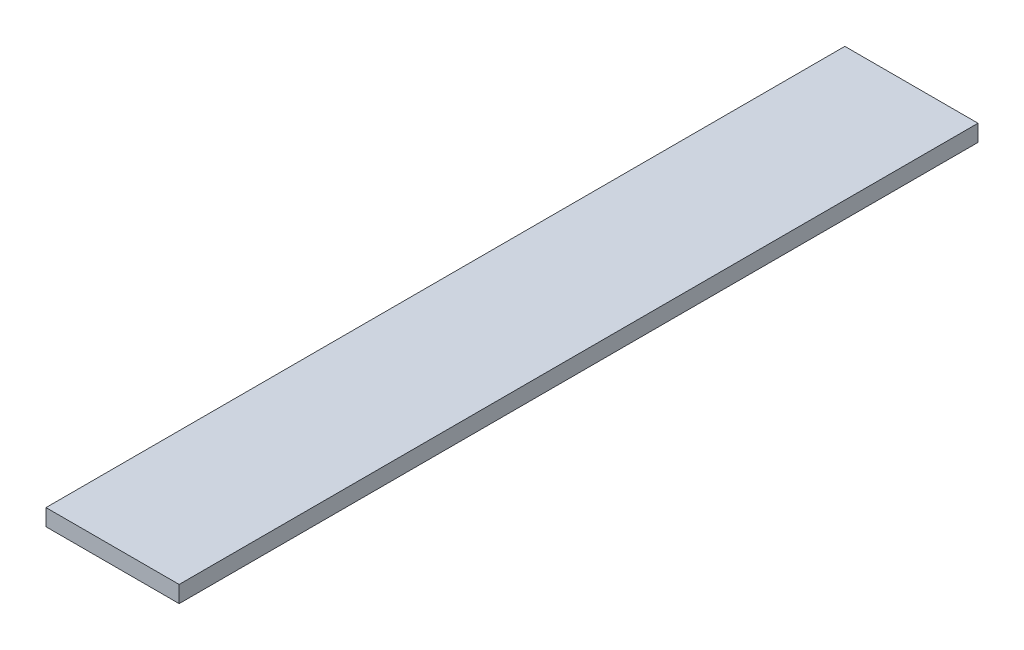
from build123d import *

# Parameters (mm, degrees)
SKETCH1_W          = 50.8
SKETCH1_H          = 6.35
BASE_EXTRUDE_DEPTH = 304.8


with BuildPart() as part:
    # Sketch1 → Base-Extrude (new body)
    with BuildSketch(Plane.XY):
        with Locations((25.4, 3.175)):
            Rectangle(SKETCH1_W, SKETCH1_H)
    extrude(amount=BASE_EXTRUDE_DEPTH)


solid = part.part
